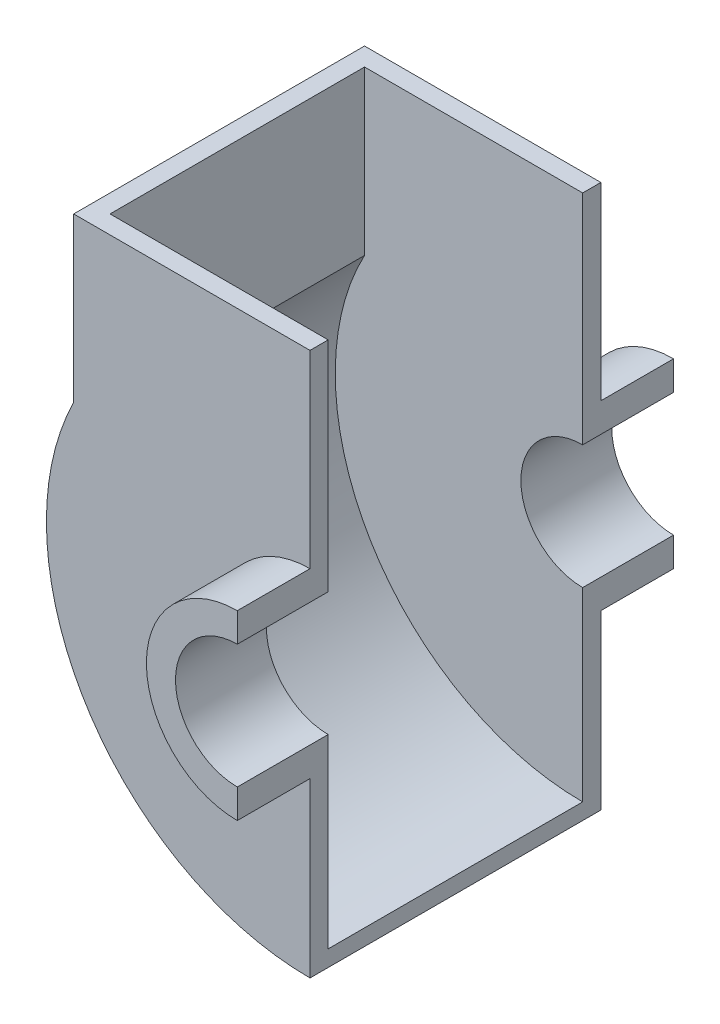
from build123d import *

# Parameters (mm, degrees)
BOSS_EXTRUDE1_DEPTH      = 20
BOSS_EXTRUDE1_DEPTH_BACK = 5
BOSS_EXTRUDE3_START      = -5
BOSS_EXTRUDE3_DEPTH      = 5
BOSS_EXTRUDE4_REACH      = 144.163


with BuildPart() as part:
    # Sketch1 → Boss-Extrude1 (new, two sides: drawn at the far end of the back side and taken through both)
    with BuildSketch(Plane.XY.offset(-BOSS_EXTRUDE1_DEPTH_BACK)):
        with BuildLine():
            Line((0, 25), (0, 17))
            ThreePointArc((0, 17), (-17, 0), (0, -17))
            Line((0, -17), (0, -25))
            ThreePointArc((0, -25), (-25, 0), (0, 25))
        make_face()
    extrude(amount=BOSS_EXTRUDE1_DEPTH + BOSS_EXTRUDE1_DEPTH_BACK)

    # Sketch2 → Boss-Extrude3 (add)
    with BuildSketch(Plane.XY.offset(BOSS_EXTRUDE3_START)):
        with BuildLine():
            ThreePointArc((0, 25), (-25, 0), (0, -25))
            Line((0, -25), (0, -72.5))
            ThreePointArc((0, -72.5), (-61.581037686, -38.262590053), (-65, 32.113081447))
            Line((-65, 32.113081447), (-65, 77))
            Line((-65, 77), (0, 77))
            Line((0, 77), (0, 25))
        make_face()
    extrude(amount=BOSS_EXTRUDE3_DEPTH)


with BuildPart() as body_2:
    # Mirror1: mirrored copy
    add(part.part.mirror(Plane.XY.offset(-40)))

    # Sketch4 → Boss-Extrude4 (add, up to next)
    with BuildSketch(Plane(origin=(0, 0, -5), x_dir=(-1, 0, 0), z_dir=(0, 0, -1)), mode=Mode.PRIVATE) as boss_extrude4_sk1:
        with BuildLine():
            Line((65, 32.113081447), (65, 77))
            Line((65, 77), (60, 77))
            Line((60, 77), (60, 32.113081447))
            ThreePointArc((60, 32.113081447), (58.380864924, -34.970339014), (0, -68.053287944))
            Line((0, -68.053287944), (0, -72.5))
            ThreePointArc((0, -72.5), (61.581037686, -38.262590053), (65, 32.113081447))
        make_face()
    boss_extrude4_tool1 = extrude(boss_extrude4_sk1.sketch, amount=BOSS_EXTRUDE4_REACH, mode=Mode.PRIVATE) - body_2.part

    add(part.part)  # Boss-Extrude4 merges part
    add(boss_extrude4_tool1.solids().sort_by_distance((-63.33848, 54.556541, -5))[0])


solid = body_2.part
